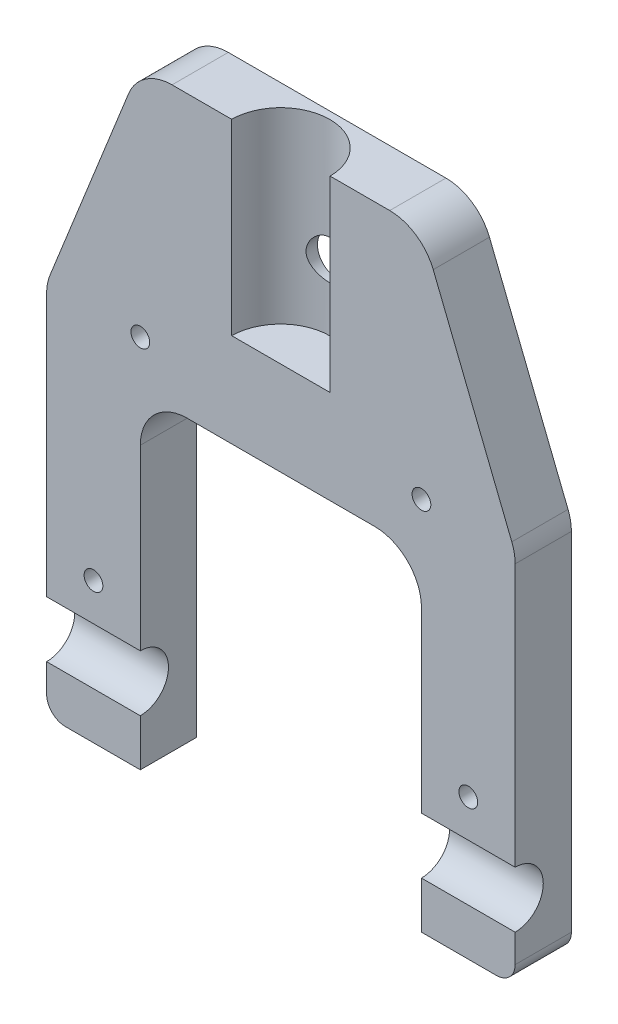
ISO-10303-21;
HEADER;
FILE_DESCRIPTION(('STEP AP214'),'2;1');
FILE_NAME('part.step','',(''),(''),'','','');
FILE_SCHEMA(('AUTOMOTIVE_DESIGN { 1 0 10303 214 1 1 1 1 }'));
ENDSEC;
DATA;
#1=APPLICATION_CONTEXT('core data for automotive mechanical design processes');
#2=APPLICATION_PROTOCOL_DEFINITION('international standard','automotive_design',2000,#1);
#3=PRODUCT_CONTEXT('',#1,'mechanical');
#4=PRODUCT('Part','Part','',(#3));
#5=PRODUCT_RELATED_PRODUCT_CATEGORY('part','',(#4));
#6=PRODUCT_DEFINITION_FORMATION('','',#4);
#7=PRODUCT_DEFINITION_CONTEXT('part definition',#1,'design');
#8=PRODUCT_DEFINITION('design','',#6,#7);
#9=PRODUCT_DEFINITION_SHAPE('','',#8);
#10=(LENGTH_UNIT() NAMED_UNIT(*) SI_UNIT(.MILLI.,.METRE.));
#11=(NAMED_UNIT(*) PLANE_ANGLE_UNIT() SI_UNIT($,.RADIAN.));
#12=(NAMED_UNIT(*) SI_UNIT($,.STERADIAN.) SOLID_ANGLE_UNIT());
#13=UNCERTAINTY_MEASURE_WITH_UNIT(LENGTH_MEASURE(1.E-05),#10,'distance_accuracy_value','');
#14=(GEOMETRIC_REPRESENTATION_CONTEXT(3) GLOBAL_UNCERTAINTY_ASSIGNED_CONTEXT((#13)) GLOBAL_UNIT_ASSIGNED_CONTEXT((#10,
#11,#12)) REPRESENTATION_CONTEXT('',''));
#15=CARTESIAN_POINT('',(0.,0.,0.));
#16=DIRECTION('',(0.,0.,1.));
#17=DIRECTION('',(1.,0.,0.));
#18=AXIS2_PLACEMENT_3D('',#15,#16,#17);
#19=CARTESIAN_POINT('',(5.,39.0370879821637,6.));
#20=DIRECTION('',(0.,0.,-1.));
#21=DIRECTION('',(-1.,0.,0.));
#22=AXIS2_PLACEMENT_3D('',#19,#20,#21);
#23=PLANE('',#22);
#24=CARTESIAN_POINT('',(40.,40.,6.));
#25=DIRECTION('',(0.,0.,1.));
#26=DIRECTION('',(-1.,0.,0.));
#27=AXIS2_PLACEMENT_3D('',#24,#25,#26);
#28=CIRCLE('',#27,0.999999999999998);
#29=CARTESIAN_POINT('',(39.,40.,6.));
#30=VERTEX_POINT('',#29);
#31=EDGE_CURVE('E511',#30,#30,#28,.T.);
#32=ORIENTED_EDGE('',*,*,#31,.F.);
#33=EDGE_LOOP('',(#32));
#34=FACE_BOUND('',#33,.T.);
#35=CARTESIAN_POINT('',(45.,15.,6.));
#36=DIRECTION('',(0.,0.,1.));
#37=DIRECTION('',(-1.,0.,0.));
#38=AXIS2_PLACEMENT_3D('',#35,#36,#37);
#39=CIRCLE('',#38,0.999999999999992);
#40=CARTESIAN_POINT('',(44.,15.,6.));
#41=VERTEX_POINT('',#40);
#42=EDGE_CURVE('E506',#41,#41,#39,.T.);
#43=ORIENTED_EDGE('',*,*,#42,.F.);
#44=EDGE_LOOP('',(#43));
#45=FACE_BOUND('',#44,.T.);
#46=CARTESIAN_POINT('',(10.,40.,6.));
#47=DIRECTION('',(0.,0.,1.));
#48=DIRECTION('',(1.,0.,0.));
#49=AXIS2_PLACEMENT_3D('',#46,#47,#48);
#50=CIRCLE('',#49,1.);
#51=CARTESIAN_POINT('',(11.,40.,6.));
#52=VERTEX_POINT('',#51);
#53=EDGE_CURVE('E500',#52,#52,#50,.T.);
#54=ORIENTED_EDGE('',*,*,#53,.F.);
#55=EDGE_LOOP('',(#54));
#56=FACE_BOUND('',#55,.T.);
#57=CARTESIAN_POINT('',(5.,15.,6.));
#58=DIRECTION('',(0.,0.,1.));
#59=DIRECTION('',(1.,0.,0.));
#60=AXIS2_PLACEMENT_3D('',#57,#58,#59);
#61=CIRCLE('',#60,1.);
#62=CARTESIAN_POINT('',(6.,15.,6.));
#63=VERTEX_POINT('',#62);
#64=EDGE_CURVE('E494',#63,#63,#61,.T.);
#65=ORIENTED_EDGE('',*,*,#64,.F.);
#66=EDGE_LOOP('',(#65));
#67=FACE_BOUND('',#66,.T.);
#68=DIRECTION('',(0.,-1.,0.));
#69=VECTOR('',#68,1.);
#70=CARTESIAN_POINT('',(0.,2.00000000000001,6.));
#71=LINE('',#70,#69);
#72=CARTESIAN_POINT('',(0.,39.0370879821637,6.));
#73=VERTEX_POINT('',#72);
#74=CARTESIAN_POINT('',(0.,11.,6.));
#75=VERTEX_POINT('',#74);
#76=EDGE_CURVE('E198',#73,#75,#71,.T.);
#77=ORIENTED_EDGE('',*,*,#76,.T.);
#78=DIRECTION('',(1.,0.,0.));
#79=VECTOR('',#78,1.);
#80=CARTESIAN_POINT('',(0.,11.,6.));
#81=LINE('',#80,#79);
#82=CARTESIAN_POINT('',(10.,11.,6.));
#83=VERTEX_POINT('',#82);
#84=EDGE_CURVE('E184',#75,#83,#81,.T.);
#85=ORIENTED_EDGE('',*,*,#84,.T.);
#86=DIRECTION('',(0.,-1.,0.));
#87=VECTOR('',#86,1.);
#88=CARTESIAN_POINT('',(10.,30.,6.));
#89=LINE('',#88,#87);
#90=CARTESIAN_POINT('',(10.,30.,6.));
#91=VERTEX_POINT('',#90);
#92=EDGE_CURVE('E381',#91,#83,#89,.T.);
#93=ORIENTED_EDGE('',*,*,#92,.F.);
#94=CARTESIAN_POINT('',(15.,30.,6.));
#95=DIRECTION('',(0.,0.,1.));
#96=DIRECTION('',(1.,0.,0.));
#97=AXIS2_PLACEMENT_3D('',#94,#95,#96);
#98=CIRCLE('',#97,5.);
#99=CARTESIAN_POINT('',(15.,35.,6.));
#100=VERTEX_POINT('',#99);
#101=EDGE_CURVE('E382',#100,#91,#98,.T.);
#102=ORIENTED_EDGE('',*,*,#101,.F.);
#103=DIRECTION('',(-1.,0.,0.));
#104=VECTOR('',#103,1.);
#105=CARTESIAN_POINT('',(15.,35.,6.));
#106=LINE('',#105,#104);
#107=CARTESIAN_POINT('',(35.,35.,6.));
#108=VERTEX_POINT('',#107);
#109=EDGE_CURVE('E386',#108,#100,#106,.T.);
#110=ORIENTED_EDGE('',*,*,#109,.F.);
#111=CARTESIAN_POINT('',(35.,30.,6.));
#112=DIRECTION('',(0.,0.,1.));
#113=DIRECTION('',(-1.,0.,0.));
#114=AXIS2_PLACEMENT_3D('',#111,#112,#113);
#115=CIRCLE('',#114,5.);
#116=CARTESIAN_POINT('',(40.,30.,6.));
#117=VERTEX_POINT('',#116);
#118=EDGE_CURVE('E484',#117,#108,#115,.T.);
#119=ORIENTED_EDGE('',*,*,#118,.F.);
#120=DIRECTION('',(0.,1.,0.));
#121=VECTOR('',#120,1.);
#122=CARTESIAN_POINT('',(40.,30.,6.));
#123=LINE('',#122,#121);
#124=CARTESIAN_POINT('',(40.,11.,6.));
#125=VERTEX_POINT('',#124);
#126=EDGE_CURVE('E481',#125,#117,#123,.T.);
#127=ORIENTED_EDGE('',*,*,#126,.F.);
#128=CARTESIAN_POINT('',(50.,11.,6.));
#129=VERTEX_POINT('',#128);
#130=EDGE_CURVE('E41',#125,#129,#81,.T.);
#131=ORIENTED_EDGE('',*,*,#130,.T.);
#132=DIRECTION('',(0.,1.,0.));
#133=VECTOR('',#132,1.);
#134=CARTESIAN_POINT('',(50.,39.0370879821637,6.));
#135=LINE('',#134,#133);
#136=CARTESIAN_POINT('',(50.,39.0370879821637,6.));
#137=VERTEX_POINT('',#136);
#138=EDGE_CURVE('E219',#129,#137,#135,.T.);
#139=ORIENTED_EDGE('',*,*,#138,.T.);
#140=CARTESIAN_POINT('',(45.,39.0370879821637,6.));
#141=DIRECTION('',(0.,0.,1.));
#142=DIRECTION('',(-1.,0.,0.));
#143=AXIS2_PLACEMENT_3D('',#140,#141,#142);
#144=CIRCLE('',#143,5.);
#145=CARTESIAN_POINT('',(49.6423834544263,40.8940413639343,6.));
#146=VERTEX_POINT('',#145);
#147=EDGE_CURVE('E223',#137,#146,#144,.T.);
#148=ORIENTED_EDGE('',*,*,#147,.T.);
#149=DIRECTION('',(-0.371390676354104,0.928476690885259,0.));
#150=VECTOR('',#149,1.);
#151=CARTESIAN_POINT('',(41.2572186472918,61.8569533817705,6.));
#152=LINE('',#151,#150);
#153=CARTESIAN_POINT('',(41.2572186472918,61.8569533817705,6.));
#154=VERTEX_POINT('',#153);
#155=EDGE_CURVE('E225',#146,#154,#152,.T.);
#156=ORIENTED_EDGE('',*,*,#155,.T.);
#157=CARTESIAN_POINT('',(36.6148351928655,60.,6.));
#158=DIRECTION('',(0.,0.,1.));
#159=DIRECTION('',(-1.,0.,0.));
#160=AXIS2_PLACEMENT_3D('',#157,#158,#159);
#161=CIRCLE('',#160,5.);
#162=CARTESIAN_POINT('',(36.6148351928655,65.,6.));
#163=VERTEX_POINT('',#162);
#164=EDGE_CURVE('E227',#154,#163,#161,.T.);
#165=ORIENTED_EDGE('',*,*,#164,.T.);
#166=DIRECTION('',(-1.,0.,0.));
#167=VECTOR('',#166,1.);
#168=CARTESIAN_POINT('',(13.3851648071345,65.,6.));
#169=LINE('',#168,#167);
#170=CARTESIAN_POINT('',(30.2499348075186,65.,6.));
#171=VERTEX_POINT('',#170);
#172=EDGE_CURVE('E230',#163,#171,#169,.T.);
#173=ORIENTED_EDGE('',*,*,#172,.T.);
#174=DIRECTION('',(0.,1.,0.));
#175=VECTOR('',#174,1.);
#176=CARTESIAN_POINT('',(30.2499348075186,45.,6.));
#177=LINE('',#176,#175);
#178=CARTESIAN_POINT('',(30.2499348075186,45.,6.));
#179=VERTEX_POINT('',#178);
#180=EDGE_CURVE('E280',#171,#179,#177,.F.);
#181=ORIENTED_EDGE('',*,*,#180,.T.);
#182=DIRECTION('',(1.,0.,0.));
#183=VECTOR('',#182,1.);
#184=CARTESIAN_POINT('',(5.,45.,6.));
#185=LINE('',#184,#183);
#186=CARTESIAN_POINT('',(19.7500651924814,45.,6.));
#187=VERTEX_POINT('',#186);
#188=EDGE_CURVE('E272',#187,#179,#185,.T.);
#189=ORIENTED_EDGE('',*,*,#188,.F.);
#190=DIRECTION('',(0.,1.,0.));
#191=VECTOR('',#190,1.);
#192=CARTESIAN_POINT('',(19.7500651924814,45.,6.));
#193=LINE('',#192,#191);
#194=CARTESIAN_POINT('',(19.7500651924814,65.,6.));
#195=VERTEX_POINT('',#194);
#196=EDGE_CURVE('E408',#187,#195,#193,.T.);
#197=ORIENTED_EDGE('',*,*,#196,.T.);
#198=CARTESIAN_POINT('',(13.3851648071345,65.,6.));
#199=VERTEX_POINT('',#198);
#200=EDGE_CURVE('E229',#195,#199,#169,.T.);
#201=ORIENTED_EDGE('',*,*,#200,.T.);
#202=CARTESIAN_POINT('',(13.3851648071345,60.,6.));
#203=DIRECTION('',(0.,0.,1.));
#204=DIRECTION('',(-1.,0.,0.));
#205=AXIS2_PLACEMENT_3D('',#202,#203,#204);
#206=CIRCLE('',#205,5.);
#207=CARTESIAN_POINT('',(8.7427813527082,61.8569533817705,6.));
#208=VERTEX_POINT('',#207);
#209=EDGE_CURVE('E233',#199,#208,#206,.T.);
#210=ORIENTED_EDGE('',*,*,#209,.T.);
#211=DIRECTION('',(-0.371390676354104,-0.928476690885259,0.));
#212=VECTOR('',#211,1.);
#213=CARTESIAN_POINT('',(0.35761654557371,40.8940413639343,6.));
#214=LINE('',#213,#212);
#215=CARTESIAN_POINT('',(0.35761654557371,40.8940413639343,6.));
#216=VERTEX_POINT('',#215);
#217=EDGE_CURVE('E235',#208,#216,#214,.T.);
#218=ORIENTED_EDGE('',*,*,#217,.T.);
#219=CARTESIAN_POINT('',(5.,39.0370879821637,6.));
#220=DIRECTION('',(0.,0.,1.));
#221=DIRECTION('',(-1.,0.,0.));
#222=AXIS2_PLACEMENT_3D('',#219,#220,#221);
#223=CIRCLE('',#222,5.);
#224=EDGE_CURVE('E205',#216,#73,#223,.T.);
#225=ORIENTED_EDGE('',*,*,#224,.T.);
#226=EDGE_LOOP('',(#77,#85,#93,#102,#110,#119,#127,#131,#139,#148,#156,#165,#173,#181,#189,#197,
#201,#210,#218,#225));
#227=FACE_BOUND('',#226,.T.);
#228=ADVANCED_FACE('F26',(#34,#45,#56,#67,#227),#23,.F.);
#229=CARTESIAN_POINT('',(50.,2.00000000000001,6.));
#230=VERTEX_POINT('',#229);
#231=CARTESIAN_POINT('',(50.,5.,6.));
#232=VERTEX_POINT('',#231);
#233=EDGE_CURVE('E220',#230,#232,#135,.T.);
#234=ORIENTED_EDGE('',*,*,#233,.T.);
#235=DIRECTION('',(1.,0.,0.));
#236=VECTOR('',#235,1.);
#237=CARTESIAN_POINT('',(0.,5.,6.));
#238=LINE('',#237,#236);
#239=CARTESIAN_POINT('',(40.,5.,6.));
#240=VERTEX_POINT('',#239);
#241=EDGE_CURVE('E485',#232,#240,#238,.F.);
#242=ORIENTED_EDGE('',*,*,#241,.T.);
#243=CARTESIAN_POINT('',(40.,0.,6.));
#244=VERTEX_POINT('',#243);
#245=EDGE_CURVE('E482',#244,#240,#123,.T.);
#246=ORIENTED_EDGE('',*,*,#245,.F.);
#247=DIRECTION('',(1.,0.,0.));
#248=VECTOR('',#247,1.);
#249=CARTESIAN_POINT('',(48.,0.,6.));
#250=LINE('',#249,#248);
#251=CARTESIAN_POINT('',(48.,0.,6.));
#252=VERTEX_POINT('',#251);
#253=EDGE_CURVE('E209',#244,#252,#250,.T.);
#254=ORIENTED_EDGE('',*,*,#253,.T.);
#255=CARTESIAN_POINT('',(48.,2.,6.));
#256=DIRECTION('',(0.,0.,1.));
#257=DIRECTION('',(-1.,0.,0.));
#258=AXIS2_PLACEMENT_3D('',#255,#256,#257);
#259=CIRCLE('',#258,2.);
#260=EDGE_CURVE('E217',#252,#230,#259,.T.);
#261=ORIENTED_EDGE('',*,*,#260,.T.);
#262=EDGE_LOOP('',(#234,#242,#246,#254,#261));
#263=FACE_BOUND('',#262,.T.);
#264=ADVANCED_FACE('F353',(#263),#23,.F.);
#265=CARTESIAN_POINT('',(48.,0.,6.));
#266=DIRECTION('',(0.,1.,0.));
#267=DIRECTION('',(0.,0.,1.));
#268=AXIS2_PLACEMENT_3D('',#265,#266,#267);
#269=PLANE('',#268);
#270=ORIENTED_EDGE('',*,*,#253,.F.);
#271=DIRECTION('',(0.,0.,-1.));
#272=VECTOR('',#271,1.);
#273=CARTESIAN_POINT('',(40.,0.,6.));
#274=LINE('',#273,#272);
#275=CARTESIAN_POINT('',(40.,0.,0.));
#276=VERTEX_POINT('',#275);
#277=EDGE_CURVE('E459',#244,#276,#274,.T.);
#278=ORIENTED_EDGE('',*,*,#277,.T.);
#279=DIRECTION('',(1.,0.,0.));
#280=VECTOR('',#279,1.);
#281=CARTESIAN_POINT('',(48.,0.,0.));
#282=LINE('',#281,#280);
#283=CARTESIAN_POINT('',(48.,0.,0.));
#284=VERTEX_POINT('',#283);
#285=EDGE_CURVE('E421',#276,#284,#282,.T.);
#286=ORIENTED_EDGE('',*,*,#285,.T.);
#287=DIRECTION('',(0.,0.,-1.));
#288=VECTOR('',#287,1.);
#289=CARTESIAN_POINT('',(48.,0.,6.));
#290=LINE('',#289,#288);
#291=EDGE_CURVE('E261',#252,#284,#290,.T.);
#292=ORIENTED_EDGE('',*,*,#291,.F.);
#293=EDGE_LOOP('',(#270,#278,#286,#292));
#294=FACE_BOUND('',#293,.T.);
#295=ADVANCED_FACE('F360',(#294),#269,.F.);
#296=CARTESIAN_POINT('',(10.,5.,6.));
#297=VERTEX_POINT('',#296);
#298=CARTESIAN_POINT('',(10.,0.,6.));
#299=VERTEX_POINT('',#298);
#300=EDGE_CURVE('E378',#297,#299,#89,.T.);
#301=ORIENTED_EDGE('',*,*,#300,.F.);
#302=CARTESIAN_POINT('',(0.,5.,6.));
#303=VERTEX_POINT('',#302);
#304=EDGE_CURVE('E49',#297,#303,#238,.F.);
#305=ORIENTED_EDGE('',*,*,#304,.T.);
#306=CARTESIAN_POINT('',(0.,2.00000000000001,6.));
#307=VERTEX_POINT('',#306);
#308=EDGE_CURVE('E201',#303,#307,#71,.T.);
#309=ORIENTED_EDGE('',*,*,#308,.T.);
#310=CARTESIAN_POINT('',(2.,2.,6.));
#311=DIRECTION('',(0.,0.,1.));
#312=DIRECTION('',(1.,0.,0.));
#313=AXIS2_PLACEMENT_3D('',#310,#311,#312);
#314=CIRCLE('',#313,2.);
#315=CARTESIAN_POINT('',(2.00000000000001,0.,6.));
#316=VERTEX_POINT('',#315);
#317=EDGE_CURVE('E207',#307,#316,#314,.T.);
#318=ORIENTED_EDGE('',*,*,#317,.T.);
#319=EDGE_CURVE('E214',#316,#299,#250,.T.);
#320=ORIENTED_EDGE('',*,*,#319,.T.);
#321=EDGE_LOOP('',(#301,#305,#309,#318,#320));
#322=FACE_BOUND('',#321,.T.);
#323=ADVANCED_FACE('F356',(#322),#23,.F.);
#324=CARTESIAN_POINT('',(5.,39.0370879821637,0.));
#325=DIRECTION('',(0.,0.,-1.));
#326=DIRECTION('',(-1.,0.,0.));
#327=AXIS2_PLACEMENT_3D('',#324,#325,#326);
#328=PLANE('',#327);
#329=DIRECTION('',(0.,-1.,0.));
#330=VECTOR('',#329,1.);
#331=CARTESIAN_POINT('',(40.,39.0370879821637,0.));
#332=LINE('',#331,#330);
#333=CARTESIAN_POINT('',(40.,30.,0.));
#334=VERTEX_POINT('',#333);
#335=EDGE_CURVE('E400',#334,#276,#332,.T.);
#336=ORIENTED_EDGE('',*,*,#335,.F.);
#337=CARTESIAN_POINT('',(35.,30.,0.));
#338=DIRECTION('',(0.,0.,-1.));
#339=DIRECTION('',(-1.,0.,0.));
#340=AXIS2_PLACEMENT_3D('',#337,#338,#339);
#341=CIRCLE('',#340,5.);
#342=CARTESIAN_POINT('',(35.,35.,0.));
#343=VERTEX_POINT('',#342);
#344=EDGE_CURVE('E461',#343,#334,#341,.T.);
#345=ORIENTED_EDGE('',*,*,#344,.F.);
#346=DIRECTION('',(1.,0.,0.));
#347=VECTOR('',#346,1.);
#348=CARTESIAN_POINT('',(5.,35.,0.));
#349=LINE('',#348,#347);
#350=CARTESIAN_POINT('',(15.,35.,0.));
#351=VERTEX_POINT('',#350);
#352=EDGE_CURVE('E465',#351,#343,#349,.T.);
#353=ORIENTED_EDGE('',*,*,#352,.F.);
#354=CARTESIAN_POINT('',(15.,30.,0.));
#355=DIRECTION('',(0.,0.,-1.));
#356=DIRECTION('',(-1.,0.,0.));
#357=AXIS2_PLACEMENT_3D('',#354,#355,#356);
#358=CIRCLE('',#357,5.);
#359=CARTESIAN_POINT('',(10.,30.,0.));
#360=VERTEX_POINT('',#359);
#361=EDGE_CURVE('E34',#360,#351,#358,.T.);
#362=ORIENTED_EDGE('',*,*,#361,.F.);
#363=DIRECTION('',(0.,1.,0.));
#364=VECTOR('',#363,1.);
#365=CARTESIAN_POINT('',(10.,39.0370879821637,0.));
#366=LINE('',#365,#364);
#367=CARTESIAN_POINT('',(10.,0.,0.));
#368=VERTEX_POINT('',#367);
#369=EDGE_CURVE('E392',#368,#360,#366,.T.);
#370=ORIENTED_EDGE('',*,*,#369,.F.);
#371=CARTESIAN_POINT('',(2.00000000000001,0.,0.));
#372=VERTEX_POINT('',#371);
#373=EDGE_CURVE('E422',#372,#368,#282,.T.);
#374=ORIENTED_EDGE('',*,*,#373,.F.);
#375=CARTESIAN_POINT('',(2.,2.,0.));
#376=DIRECTION('',(0.,0.,1.));
#377=DIRECTION('',(1.,0.,0.));
#378=AXIS2_PLACEMENT_3D('',#375,#376,#377);
#379=CIRCLE('',#378,2.);
#380=CARTESIAN_POINT('',(0.,2.00000000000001,0.));
#381=VERTEX_POINT('',#380);
#382=EDGE_CURVE('E419',#381,#372,#379,.T.);
#383=ORIENTED_EDGE('',*,*,#382,.F.);
#384=DIRECTION('',(0.,-1.,0.));
#385=VECTOR('',#384,1.);
#386=CARTESIAN_POINT('',(0.,2.00000000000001,0.));
#387=LINE('',#386,#385);
#388=CARTESIAN_POINT('',(0.,39.0370879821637,0.));
#389=VERTEX_POINT('',#388);
#390=EDGE_CURVE('E417',#389,#381,#387,.T.);
#391=ORIENTED_EDGE('',*,*,#390,.F.);
#392=CARTESIAN_POINT('',(5.,39.0370879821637,0.));
#393=DIRECTION('',(0.,0.,1.));
#394=DIRECTION('',(-1.,0.,0.));
#395=AXIS2_PLACEMENT_3D('',#392,#393,#394);
#396=CIRCLE('',#395,5.);
#397=CARTESIAN_POINT('',(0.35761654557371,40.8940413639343,0.));
#398=VERTEX_POINT('',#397);
#399=EDGE_CURVE('E414',#398,#389,#396,.T.);
#400=ORIENTED_EDGE('',*,*,#399,.F.);
#401=DIRECTION('',(-0.371390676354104,-0.928476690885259,0.));
#402=VECTOR('',#401,1.);
#403=CARTESIAN_POINT('',(0.35761654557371,40.8940413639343,0.));
#404=LINE('',#403,#402);
#405=CARTESIAN_POINT('',(8.7427813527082,61.8569533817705,0.));
#406=VERTEX_POINT('',#405);
#407=EDGE_CURVE('E438',#406,#398,#404,.T.);
#408=ORIENTED_EDGE('',*,*,#407,.F.);
#409=CARTESIAN_POINT('',(13.3851648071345,60.,0.));
#410=DIRECTION('',(0.,0.,1.));
#411=DIRECTION('',(-1.,0.,0.));
#412=AXIS2_PLACEMENT_3D('',#409,#410,#411);
#413=CIRCLE('',#412,5.);
#414=CARTESIAN_POINT('',(13.3851648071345,65.,0.));
#415=VERTEX_POINT('',#414);
#416=EDGE_CURVE('E437',#415,#406,#413,.T.);
#417=ORIENTED_EDGE('',*,*,#416,.F.);
#418=DIRECTION('',(-1.,0.,0.));
#419=VECTOR('',#418,1.);
#420=CARTESIAN_POINT('',(13.3851648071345,65.,0.));
#421=LINE('',#420,#419);
#422=CARTESIAN_POINT('',(36.6148351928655,65.,0.));
#423=VERTEX_POINT('',#422);
#424=EDGE_CURVE('E435',#423,#415,#421,.T.);
#425=ORIENTED_EDGE('',*,*,#424,.F.);
#426=CARTESIAN_POINT('',(36.6148351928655,60.,0.));
#427=DIRECTION('',(0.,0.,1.));
#428=DIRECTION('',(-1.,0.,0.));
#429=AXIS2_PLACEMENT_3D('',#426,#427,#428);
#430=CIRCLE('',#429,5.);
#431=CARTESIAN_POINT('',(41.2572186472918,61.8569533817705,0.));
#432=VERTEX_POINT('',#431);
#433=EDGE_CURVE('E433',#432,#423,#430,.T.);
#434=ORIENTED_EDGE('',*,*,#433,.F.);
#435=DIRECTION('',(-0.371390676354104,0.928476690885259,0.));
#436=VECTOR('',#435,1.);
#437=CARTESIAN_POINT('',(41.2572186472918,61.8569533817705,0.));
#438=LINE('',#437,#436);
#439=CARTESIAN_POINT('',(49.6423834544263,40.8940413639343,0.));
#440=VERTEX_POINT('',#439);
#441=EDGE_CURVE('E431',#440,#432,#438,.T.);
#442=ORIENTED_EDGE('',*,*,#441,.F.);
#443=CARTESIAN_POINT('',(45.,39.0370879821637,0.));
#444=DIRECTION('',(0.,0.,1.));
#445=DIRECTION('',(-1.,0.,0.));
#446=AXIS2_PLACEMENT_3D('',#443,#444,#445);
#447=CIRCLE('',#446,5.);
#448=CARTESIAN_POINT('',(50.,39.0370879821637,0.));
#449=VERTEX_POINT('',#448);
#450=EDGE_CURVE('E429',#449,#440,#447,.T.);
#451=ORIENTED_EDGE('',*,*,#450,.F.);
#452=DIRECTION('',(0.,1.,0.));
#453=VECTOR('',#452,1.);
#454=CARTESIAN_POINT('',(50.,39.0370879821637,0.));
#455=LINE('',#454,#453);
#456=CARTESIAN_POINT('',(50.,2.00000000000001,0.));
#457=VERTEX_POINT('',#456);
#458=EDGE_CURVE('E427',#457,#449,#455,.T.);
#459=ORIENTED_EDGE('',*,*,#458,.F.);
#460=CARTESIAN_POINT('',(48.,2.,0.));
#461=DIRECTION('',(0.,0.,1.));
#462=DIRECTION('',(-1.,0.,0.));
#463=AXIS2_PLACEMENT_3D('',#460,#461,#462);
#464=CIRCLE('',#463,2.);
#465=EDGE_CURVE('E425',#284,#457,#464,.T.);
#466=ORIENTED_EDGE('',*,*,#465,.F.);
#467=ORIENTED_EDGE('',*,*,#285,.F.);
#468=EDGE_LOOP('',(#336,#345,#353,#362,#370,#374,#383,#391,#400,#408,#417,#425,#434,#442,#451,
#459,#466,#467));
#469=FACE_BOUND('',#468,.T.);
#470=CARTESIAN_POINT('',(25.,52.,0.));
#471=DIRECTION('',(0.,0.,1.));
#472=DIRECTION('',(1.,0.,0.));
#473=AXIS2_PLACEMENT_3D('',#470,#471,#472);
#474=CIRCLE('',#473,2.1);
#475=CARTESIAN_POINT('',(27.1,52.,0.));
#476=VERTEX_POINT('',#475);
#477=EDGE_CURVE('E411',#476,#476,#474,.T.);
#478=ORIENTED_EDGE('',*,*,#477,.T.);
#479=EDGE_LOOP('',(#478));
#480=FACE_BOUND('',#479,.T.);
#481=ADVANCED_FACE('F366',(#469,#480),#328,.T.);
#482=CARTESIAN_POINT('',(5.,39.0370879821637,6.));
#483=DIRECTION('',(0.,0.,-1.));
#484=DIRECTION('',(-1.,0.,0.));
#485=AXIS2_PLACEMENT_3D('',#482,#483,#484);
#486=CYLINDRICAL_SURFACE('',#485,5.);
#487=ORIENTED_EDGE('',*,*,#399,.T.);
#488=DIRECTION('',(0.,0.,-1.));
#489=VECTOR('',#488,1.);
#490=CARTESIAN_POINT('',(0.,39.0370879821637,6.));
#491=LINE('',#490,#489);
#492=EDGE_CURVE('E270',#73,#389,#491,.T.);
#493=ORIENTED_EDGE('',*,*,#492,.F.);
#494=ORIENTED_EDGE('',*,*,#224,.F.);
#495=DIRECTION('',(0.,0.,-1.));
#496=VECTOR('',#495,1.);
#497=CARTESIAN_POINT('',(0.35761654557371,40.8940413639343,6.));
#498=LINE('',#497,#496);
#499=EDGE_CURVE('E237',#216,#398,#498,.T.);
#500=ORIENTED_EDGE('',*,*,#499,.T.);
#501=EDGE_LOOP('',(#487,#493,#494,#500));
#502=FACE_BOUND('',#501,.T.);
#503=ADVANCED_FACE('F28',(#502),#486,.T.);
#504=CARTESIAN_POINT('',(0.,2.00000000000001,6.));
#505=DIRECTION('',(1.,0.,0.));
#506=DIRECTION('',(0.,0.,-1.));
#507=AXIS2_PLACEMENT_3D('',#504,#505,#506);
#508=PLANE('',#507);
#509=ORIENTED_EDGE('',*,*,#308,.F.);
#510=CARTESIAN_POINT('',(0.,8.,6.));
#511=DIRECTION('',(1.,0.,0.));
#512=DIRECTION('',(0.,0.,-1.));
#513=AXIS2_PLACEMENT_3D('',#510,#511,#512);
#514=CIRCLE('',#513,3.);
#515=EDGE_CURVE('E187',#303,#75,#514,.T.);
#516=ORIENTED_EDGE('',*,*,#515,.T.);
#517=ORIENTED_EDGE('',*,*,#76,.F.);
#518=ORIENTED_EDGE('',*,*,#492,.T.);
#519=ORIENTED_EDGE('',*,*,#390,.T.);
#520=DIRECTION('',(0.,0.,-1.));
#521=VECTOR('',#520,1.);
#522=CARTESIAN_POINT('',(0.,2.00000000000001,6.));
#523=LINE('',#522,#521);
#524=EDGE_CURVE('E267',#307,#381,#523,.T.);
#525=ORIENTED_EDGE('',*,*,#524,.F.);
#526=EDGE_LOOP('',(#509,#516,#517,#518,#519,#525));
#527=FACE_BOUND('',#526,.T.);
#528=ADVANCED_FACE('F196',(#527),#508,.F.);
#529=CARTESIAN_POINT('',(2.,2.,6.));
#530=DIRECTION('',(0.,0.,-1.));
#531=DIRECTION('',(-1.,0.,0.));
#532=AXIS2_PLACEMENT_3D('',#529,#530,#531);
#533=CYLINDRICAL_SURFACE('',#532,2.);
#534=ORIENTED_EDGE('',*,*,#382,.T.);
#535=DIRECTION('',(0.,0.,-1.));
#536=VECTOR('',#535,1.);
#537=CARTESIAN_POINT('',(2.00000000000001,0.,6.));
#538=LINE('',#537,#536);
#539=EDGE_CURVE('E264',#316,#372,#538,.T.);
#540=ORIENTED_EDGE('',*,*,#539,.F.);
#541=ORIENTED_EDGE('',*,*,#317,.F.);
#542=ORIENTED_EDGE('',*,*,#524,.T.);
#543=EDGE_LOOP('',(#534,#540,#541,#542));
#544=FACE_BOUND('',#543,.T.);
#545=ADVANCED_FACE('F454',(#544),#533,.T.);
#546=ORIENTED_EDGE('',*,*,#373,.T.);
#547=DIRECTION('',(0.,0.,1.));
#548=VECTOR('',#547,1.);
#549=CARTESIAN_POINT('',(10.,0.,6.));
#550=LINE('',#549,#548);
#551=EDGE_CURVE('E457',#368,#299,#550,.T.);
#552=ORIENTED_EDGE('',*,*,#551,.T.);
#553=ORIENTED_EDGE('',*,*,#319,.F.);
#554=ORIENTED_EDGE('',*,*,#539,.T.);
#555=EDGE_LOOP('',(#546,#552,#553,#554));
#556=FACE_BOUND('',#555,.T.);
#557=ADVANCED_FACE('F376',(#556),#269,.F.);
#558=CARTESIAN_POINT('',(48.,2.,6.));
#559=DIRECTION('',(0.,0.,-1.));
#560=DIRECTION('',(-1.,0.,0.));
#561=AXIS2_PLACEMENT_3D('',#558,#559,#560);
#562=CYLINDRICAL_SURFACE('',#561,2.);
#563=ORIENTED_EDGE('',*,*,#465,.T.);
#564=DIRECTION('',(0.,0.,-1.));
#565=VECTOR('',#564,1.);
#566=CARTESIAN_POINT('',(50.,2.00000000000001,6.));
#567=LINE('',#566,#565);
#568=EDGE_CURVE('E258',#230,#457,#567,.T.);
#569=ORIENTED_EDGE('',*,*,#568,.F.);
#570=ORIENTED_EDGE('',*,*,#260,.F.);
#571=ORIENTED_EDGE('',*,*,#291,.T.);
#572=EDGE_LOOP('',(#563,#569,#570,#571));
#573=FACE_BOUND('',#572,.T.);
#574=ADVANCED_FACE('F565',(#573),#562,.T.);
#575=CARTESIAN_POINT('',(50.,39.0370879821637,6.));
#576=DIRECTION('',(-1.,0.,0.));
#577=DIRECTION('',(0.,0.,1.));
#578=AXIS2_PLACEMENT_3D('',#575,#576,#577);
#579=PLANE('',#578);
#580=ORIENTED_EDGE('',*,*,#138,.F.);
#581=CARTESIAN_POINT('',(50.,8.,6.));
#582=DIRECTION('',(1.,0.,0.));
#583=DIRECTION('',(0.,0.,-1.));
#584=AXIS2_PLACEMENT_3D('',#581,#582,#583);
#585=CIRCLE('',#584,3.);
#586=EDGE_CURVE('E202',#232,#129,#585,.T.);
#587=ORIENTED_EDGE('',*,*,#586,.F.);
#588=ORIENTED_EDGE('',*,*,#233,.F.);
#589=ORIENTED_EDGE('',*,*,#568,.T.);
#590=ORIENTED_EDGE('',*,*,#458,.T.);
#591=DIRECTION('',(0.,0.,-1.));
#592=VECTOR('',#591,1.);
#593=CARTESIAN_POINT('',(50.,39.0370879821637,6.));
#594=LINE('',#593,#592);
#595=EDGE_CURVE('E255',#137,#449,#594,.T.);
#596=ORIENTED_EDGE('',*,*,#595,.F.);
#597=EDGE_LOOP('',(#580,#587,#588,#589,#590,#596));
#598=FACE_BOUND('',#597,.T.);
#599=ADVANCED_FACE('F532',(#598),#579,.F.);
#600=CARTESIAN_POINT('',(45.,39.0370879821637,6.));
#601=DIRECTION('',(0.,0.,-1.));
#602=DIRECTION('',(-1.,0.,0.));
#603=AXIS2_PLACEMENT_3D('',#600,#601,#602);
#604=CYLINDRICAL_SURFACE('',#603,5.);
#605=ORIENTED_EDGE('',*,*,#450,.T.);
#606=DIRECTION('',(0.,0.,-1.));
#607=VECTOR('',#606,1.);
#608=CARTESIAN_POINT('',(49.6423834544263,40.8940413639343,6.));
#609=LINE('',#608,#607);
#610=EDGE_CURVE('E252',#146,#440,#609,.T.);
#611=ORIENTED_EDGE('',*,*,#610,.F.);
#612=ORIENTED_EDGE('',*,*,#147,.F.);
#613=ORIENTED_EDGE('',*,*,#595,.T.);
#614=EDGE_LOOP('',(#605,#611,#612,#613));
#615=FACE_BOUND('',#614,.T.);
#616=ADVANCED_FACE('F538',(#615),#604,.T.);
#617=CARTESIAN_POINT('',(41.2572186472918,61.8569533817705,6.));
#618=DIRECTION('',(-0.928476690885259,-0.371390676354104,0.));
#619=DIRECTION('',(0.371390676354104,-0.928476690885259,0.));
#620=AXIS2_PLACEMENT_3D('',#617,#618,#619);
#621=PLANE('',#620);
#622=ORIENTED_EDGE('',*,*,#441,.T.);
#623=DIRECTION('',(0.,0.,-1.));
#624=VECTOR('',#623,1.);
#625=CARTESIAN_POINT('',(41.2572186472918,61.8569533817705,6.));
#626=LINE('',#625,#624);
#627=EDGE_CURVE('E249',#154,#432,#626,.T.);
#628=ORIENTED_EDGE('',*,*,#627,.F.);
#629=ORIENTED_EDGE('',*,*,#155,.F.);
#630=ORIENTED_EDGE('',*,*,#610,.T.);
#631=EDGE_LOOP('',(#622,#628,#629,#630));
#632=FACE_BOUND('',#631,.T.);
#633=ADVANCED_FACE('F544',(#632),#621,.F.);
#634=CARTESIAN_POINT('',(36.6148351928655,60.,6.));
#635=DIRECTION('',(0.,0.,-1.));
#636=DIRECTION('',(-1.,0.,0.));
#637=AXIS2_PLACEMENT_3D('',#634,#635,#636);
#638=CYLINDRICAL_SURFACE('',#637,5.);
#639=ORIENTED_EDGE('',*,*,#433,.T.);
#640=DIRECTION('',(0.,0.,-1.));
#641=VECTOR('',#640,1.);
#642=CARTESIAN_POINT('',(36.6148351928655,65.,6.));
#643=LINE('',#642,#641);
#644=EDGE_CURVE('E246',#163,#423,#643,.T.);
#645=ORIENTED_EDGE('',*,*,#644,.F.);
#646=ORIENTED_EDGE('',*,*,#164,.F.);
#647=ORIENTED_EDGE('',*,*,#627,.T.);
#648=EDGE_LOOP('',(#639,#645,#646,#647));
#649=FACE_BOUND('',#648,.T.);
#650=ADVANCED_FACE('F548',(#649),#638,.T.);
#651=CARTESIAN_POINT('',(13.3851648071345,65.,6.));
#652=DIRECTION('',(0.,-1.,0.));
#653=DIRECTION('',(0.,0.,-1.));
#654=AXIS2_PLACEMENT_3D('',#651,#652,#653);
#655=PLANE('',#654);
#656=ORIENTED_EDGE('',*,*,#200,.F.);
#657=CARTESIAN_POINT('',(25.,65.,6.02616327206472));
#658=DIRECTION('',(0.,1.,0.));
#659=DIRECTION('',(0.,0.,1.));
#660=AXIS2_PLACEMENT_3D('',#657,#658,#659);
#661=CIRCLE('',#660,5.25);
#662=EDGE_CURVE('E402',#171,#195,#661,.T.);
#663=ORIENTED_EDGE('',*,*,#662,.F.);
#664=ORIENTED_EDGE('',*,*,#172,.F.);
#665=ORIENTED_EDGE('',*,*,#644,.T.);
#666=ORIENTED_EDGE('',*,*,#424,.T.);
#667=DIRECTION('',(0.,0.,-1.));
#668=VECTOR('',#667,1.);
#669=CARTESIAN_POINT('',(13.3851648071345,65.,6.));
#670=LINE('',#669,#668);
#671=EDGE_CURVE('E243',#199,#415,#670,.T.);
#672=ORIENTED_EDGE('',*,*,#671,.F.);
#673=EDGE_LOOP('',(#656,#663,#664,#665,#666,#672));
#674=FACE_BOUND('',#673,.T.);
#675=ADVANCED_FACE('F554',(#674),#655,.F.);
#676=CARTESIAN_POINT('',(13.3851648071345,60.,6.));
#677=DIRECTION('',(0.,0.,-1.));
#678=DIRECTION('',(-1.,0.,0.));
#679=AXIS2_PLACEMENT_3D('',#676,#677,#678);
#680=CYLINDRICAL_SURFACE('',#679,5.);
#681=ORIENTED_EDGE('',*,*,#416,.T.);
#682=DIRECTION('',(0.,0.,-1.));
#683=VECTOR('',#682,1.);
#684=CARTESIAN_POINT('',(8.7427813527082,61.8569533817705,6.));
#685=LINE('',#684,#683);
#686=EDGE_CURVE('E240',#208,#406,#685,.T.);
#687=ORIENTED_EDGE('',*,*,#686,.F.);
#688=ORIENTED_EDGE('',*,*,#209,.F.);
#689=ORIENTED_EDGE('',*,*,#671,.T.);
#690=EDGE_LOOP('',(#681,#687,#688,#689));
#691=FACE_BOUND('',#690,.T.);
#692=ADVANCED_FACE('F561',(#691),#680,.T.);
#693=CARTESIAN_POINT('',(0.35761654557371,40.8940413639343,6.));
#694=DIRECTION('',(0.928476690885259,-0.371390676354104,0.));
#695=DIRECTION('',(0.371390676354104,0.928476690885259,0.));
#696=AXIS2_PLACEMENT_3D('',#693,#694,#695);
#697=PLANE('',#696);
#698=ORIENTED_EDGE('',*,*,#407,.T.);
#699=ORIENTED_EDGE('',*,*,#499,.F.);
#700=ORIENTED_EDGE('',*,*,#217,.F.);
#701=ORIENTED_EDGE('',*,*,#686,.T.);
#702=EDGE_LOOP('',(#698,#699,#700,#701));
#703=FACE_BOUND('',#702,.T.);
#704=ADVANCED_FACE('F442',(#703),#697,.F.);
#705=CARTESIAN_POINT('',(25.,52.,6.));
#706=DIRECTION('',(0.,0.,-1.));
#707=DIRECTION('',(-1.,0.,0.));
#708=AXIS2_PLACEMENT_3D('',#705,#706,#707);
#709=CYLINDRICAL_SURFACE('',#708,2.1);
#710=CARTESIAN_POINT('',(22.9,52.,1.21445879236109));
#711=CARTESIAN_POINT('',(22.9000048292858,52.1124798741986,1.21445403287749));
#712=CARTESIAN_POINT('',(22.9090911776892,52.2251476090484,1.21045971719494));
#713=CARTESIAN_POINT('',(22.9450795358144,52.4472360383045,1.19499689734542));
#714=CARTESIAN_POINT('',(22.9720270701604,52.5566476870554,1.18350929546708));
#715=CARTESIAN_POINT('',(23.0425526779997,52.7686543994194,1.15457895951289));
#716=CARTESIAN_POINT('',(23.0860680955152,52.8712734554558,1.13715868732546));
#717=CARTESIAN_POINT('',(23.1883088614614,53.0677296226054,1.09835916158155));
#718=CARTESIAN_POINT('',(23.2470308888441,53.1615686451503,1.0769807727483));
#719=CARTESIAN_POINT('',(23.3816118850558,53.3432233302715,1.0313042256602));
#720=CARTESIAN_POINT('',(23.4582016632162,53.4304742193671,1.00691214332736));
#721=CARTESIAN_POINT('',(23.6248054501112,53.5913054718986,0.958732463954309));
#722=CARTESIAN_POINT('',(23.7148241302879,53.6648810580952,0.934945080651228));
#723=CARTESIAN_POINT('',(23.9100933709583,53.7990767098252,0.889527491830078));
#724=CARTESIAN_POINT('',(24.0158045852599,53.8590715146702,0.868019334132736));
#725=CARTESIAN_POINT('',(24.2368334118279,53.9601857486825,0.830722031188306));
#726=CARTESIAN_POINT('',(24.3521470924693,54.0013128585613,0.814930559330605));
#727=CARTESIAN_POINT('',(24.5831852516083,54.0615085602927,0.791510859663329));
#728=CARTESIAN_POINT('',(24.6986195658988,54.0815486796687,0.78352443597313));
#729=CARTESIAN_POINT('',(24.9314703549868,54.1021299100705,0.775320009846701));
#730=CARTESIAN_POINT('',(25.0488860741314,54.1026782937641,0.775099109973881));
#731=CARTESIAN_POINT('',(25.2753441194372,54.0847930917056,0.782232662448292));
#732=CARTESIAN_POINT('',(25.384486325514,54.0674239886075,0.789162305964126));
#733=CARTESIAN_POINT('',(25.598156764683,54.0160074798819,0.809245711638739));
#734=CARTESIAN_POINT('',(25.7026846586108,53.9819588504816,0.822399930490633));
#735=CARTESIAN_POINT('',(25.9060428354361,53.8977316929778,0.853896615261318));
#736=CARTESIAN_POINT('',(26.0047635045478,53.8473177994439,0.872314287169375));
#737=CARTESIAN_POINT('',(26.1925985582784,53.7320117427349,0.912510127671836));
#738=CARTESIAN_POINT('',(26.2817096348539,53.6671146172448,0.934289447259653));
#739=CARTESIAN_POINT('',(26.4540072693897,53.5197184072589,0.980686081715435));
#740=CARTESIAN_POINT('',(26.5364207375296,53.4363434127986,1.00539584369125));
#741=CARTESIAN_POINT('',(26.6864127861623,53.2568598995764,1.05376583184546));
#742=CARTESIAN_POINT('',(26.7539865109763,53.1607472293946,1.07742571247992));
#743=CARTESIAN_POINT('',(26.8741493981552,52.9550600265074,1.12164584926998));
#744=CARTESIAN_POINT('',(26.9262613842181,52.8451819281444,1.14209967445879));
#745=CARTESIAN_POINT('',(27.0109350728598,52.6171737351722,1.17634357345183));
#746=CARTESIAN_POINT('',(27.0435094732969,52.4990490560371,1.19013797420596));
#747=CARTESIAN_POINT('',(27.0863026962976,52.2656124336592,1.2084507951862));
#748=CARTESIAN_POINT('',(27.0977657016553,52.150569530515,1.21348442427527));
#749=CARTESIAN_POINT('',(27.101639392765,51.9201189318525,1.21517354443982));
#750=CARTESIAN_POINT('',(27.0940558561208,51.8047113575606,1.21183157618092));
#751=CARTESIAN_POINT('',(27.0611845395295,51.5837181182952,1.19767480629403));
#752=CARTESIAN_POINT('',(27.0369297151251,51.4779474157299,1.18729646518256));
#753=CARTESIAN_POINT('',(26.9727443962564,51.2720471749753,1.16077773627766));
#754=CARTESIAN_POINT('',(26.9328104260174,51.1719188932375,1.14463607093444));
#755=CARTESIAN_POINT('',(26.8365924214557,50.9756175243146,1.10760856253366));
#756=CARTESIAN_POINT('',(26.7797110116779,50.8797695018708,1.08655687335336));
#757=CARTESIAN_POINT('',(26.6518234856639,50.6985428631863,1.04233422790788));
#758=CARTESIAN_POINT('',(26.580811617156,50.6131685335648,1.01916241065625));
#759=CARTESIAN_POINT('',(26.4204864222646,50.4487579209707,0.971243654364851));
#760=CARTESIAN_POINT('',(26.3302087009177,50.3706556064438,0.946506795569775));
#761=CARTESIAN_POINT('',(26.1372378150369,50.2305640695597,0.899855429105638));
#762=CARTESIAN_POINT('',(26.03454414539,50.1685755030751,0.877941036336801));
#763=CARTESIAN_POINT('',(25.8192939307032,50.0626999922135,0.839334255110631));
#764=CARTESIAN_POINT('',(25.7067397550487,50.0188087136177,0.822640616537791));
#765=CARTESIAN_POINT('',(25.4750132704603,49.9508737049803,0.79639978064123));
#766=CARTESIAN_POINT('',(25.3558445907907,49.9268192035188,0.786848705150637));
#767=CARTESIAN_POINT('',(25.1226573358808,49.9005200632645,0.776383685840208));
#768=CARTESIAN_POINT('',(25.0088100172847,49.8969548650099,0.774946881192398));
#769=CARTESIAN_POINT('',(24.7821944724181,49.9082482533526,0.779459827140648));
#770=CARTESIAN_POINT('',(24.6694260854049,49.9231040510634,0.78540845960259));
#771=CARTESIAN_POINT('',(24.4517205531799,49.9698741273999,0.803762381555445));
#772=CARTESIAN_POINT('',(24.3466492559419,50.0012503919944,0.815963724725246));
#773=CARTESIAN_POINT('',(24.1432815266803,50.0796054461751,0.84551632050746));
#774=CARTESIAN_POINT('',(24.0449863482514,50.126587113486,0.862868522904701));
#775=CARTESIAN_POINT('',(23.8531868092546,50.2371583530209,0.901973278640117));
#776=CARTESIAN_POINT('',(23.7600861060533,50.3013900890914,0.923886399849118));
#777=CARTESIAN_POINT('',(23.5855932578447,50.4436779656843,0.969474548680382));
#778=CARTESIAN_POINT('',(23.5042059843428,50.5217398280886,0.993150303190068));
#779=CARTESIAN_POINT('',(23.3502387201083,50.6951809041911,1.04141671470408));
#780=CARTESIAN_POINT('',(23.2785158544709,50.7913330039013,1.06597327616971));
#781=CARTESIAN_POINT('',(23.1521599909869,50.9950895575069,1.11164187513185));
#782=CARTESIAN_POINT('',(23.0975290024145,51.1026953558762,1.13275350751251));
#783=CARTESIAN_POINT('',(23.0113099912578,51.3164879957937,1.16719467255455));
#784=CARTESIAN_POINT('',(22.9780933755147,51.4219346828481,1.18105275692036));
#785=CARTESIAN_POINT('',(22.9286440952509,51.6372134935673,1.20198209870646));
#786=CARTESIAN_POINT('',(22.9123641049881,51.7470325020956,1.20907226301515));
#787=CARTESIAN_POINT('',(22.9032318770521,51.8811171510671,1.21304975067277));
#788=CARTESIAN_POINT('',(22.9020209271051,51.9048715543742,1.21357719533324));
#789=CARTESIAN_POINT('',(22.9004044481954,51.9524145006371,1.21428223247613));
#790=CARTESIAN_POINT('',(22.8999989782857,51.9762030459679,1.21445979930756));
#791=CARTESIAN_POINT('',(22.9,52.,1.21445879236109));
#792=B_SPLINE_CURVE_WITH_KNOTS('',3,(#710,#711,#712,#713,#714,#715,#716,#717,#718,#719,#720,
#721,#722,#723,#724,#725,#726,#727,#728,#729,#730,#731,#732,#733,#734,#735,#736,#737,#738,#739,
#740,#741,#742,#743,#744,#745,#746,#747,#748,#749,#750,#751,#752,#753,#754,#755,#756,#757,#758,
#759,#760,#761,#762,#763,#764,#765,#766,#767,#768,#769,#770,#771,#772,#773,#774,#775,#776,#777,
#778,#779,#780,#781,#782,#783,#784,#785,#786,#787,#788,#789,#790,#791),.UNSPECIFIED.,.T.,.F.,(4,
2,2,2,2,2,2,2,2,2,2,2,2,2,2,2,2,2,2,2,2,2,2,2,2,2,2,2,2,2,2,2,2,2,2,2,2,2,2,2,4),(0.,
0.337341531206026,0.675546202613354,1.01248436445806,1.34934900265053,1.70368399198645,
2.05814253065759,2.42657802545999,2.79486340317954,3.14531892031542,3.49564367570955,
3.82629077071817,4.15696212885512,4.49261715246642,4.82838735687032,5.18620246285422,
5.54413447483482,5.9121768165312,6.27997970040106,6.6253125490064,6.97054065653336,
7.29610610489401,7.62174376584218,7.96058712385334,8.29956870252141,8.66358920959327,
9.02762453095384,9.39157261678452,9.75532294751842,10.0953409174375,10.4353074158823,
10.7648309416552,11.0944152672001,11.4385640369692,11.7828555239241,12.1484606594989,
12.5141087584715,12.8469249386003,13.178808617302,13.2501734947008,13.3215436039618),.UNSPECIFIED.);
#793=CARTESIAN_POINT('',(22.9,52.,1.21445879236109));
#794=VERTEX_POINT('',#793);
#795=EDGE_CURVE('E273',#794,#794,#792,.T.);
#796=ORIENTED_EDGE('',*,*,#795,.F.);
#797=EDGE_LOOP('',(#796));
#798=FACE_BOUND('',#797,.T.);
#799=ORIENTED_EDGE('',*,*,#477,.F.);
#800=EDGE_LOOP('',(#799));
#801=FACE_BOUND('',#800,.T.);
#802=ADVANCED_FACE('F283',(#798,#801),#709,.F.);
#803=CARTESIAN_POINT('',(25.,45.,6.02616327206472));
#804=DIRECTION('',(0.,1.,0.));
#805=DIRECTION('',(0.,0.,1.));
#806=AXIS2_PLACEMENT_3D('',#803,#804,#805);
#807=PLANE('',#806);
#808=ORIENTED_EDGE('',*,*,#188,.T.);
#809=CARTESIAN_POINT('',(25.,45.,6.02616327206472));
#810=DIRECTION('',(0.,1.,0.));
#811=DIRECTION('',(0.,0.,1.));
#812=AXIS2_PLACEMENT_3D('',#809,#810,#811);
#813=CIRCLE('',#812,5.25);
#814=EDGE_CURVE('E281',#179,#187,#813,.T.);
#815=ORIENTED_EDGE('',*,*,#814,.T.);
#816=EDGE_LOOP('',(#808,#815));
#817=FACE_BOUND('',#816,.T.);
#818=ADVANCED_FACE('F291',(#817),#807,.T.);
#819=CARTESIAN_POINT('',(25.,45.,6.02616327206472));
#820=DIRECTION('',(0.,1.,0.));
#821=DIRECTION('',(0.,0.,1.));
#822=AXIS2_PLACEMENT_3D('',#819,#820,#821);
#823=CYLINDRICAL_SURFACE('',#822,5.25);
#824=ORIENTED_EDGE('',*,*,#795,.T.);
#825=EDGE_LOOP('',(#824));
#826=FACE_BOUND('',#825,.T.);
#827=ORIENTED_EDGE('',*,*,#814,.F.);
#828=ORIENTED_EDGE('',*,*,#180,.F.);
#829=ORIENTED_EDGE('',*,*,#662,.T.);
#830=ORIENTED_EDGE('',*,*,#196,.F.);
#831=EDGE_LOOP('',(#827,#828,#829,#830));
#832=FACE_BOUND('',#831,.T.);
#833=ADVANCED_FACE('F286',(#826,#832),#823,.F.);
#834=CARTESIAN_POINT('',(40.,30.,-4.));
#835=DIRECTION('',(1.,0.,0.));
#836=DIRECTION('',(0.,0.,-1.));
#837=AXIS2_PLACEMENT_3D('',#834,#835,#836);
#838=PLANE('',#837);
#839=ORIENTED_EDGE('',*,*,#245,.T.);
#840=CARTESIAN_POINT('',(40.,8.,6.));
#841=DIRECTION('',(1.,0.,0.));
#842=DIRECTION('',(0.,0.,-1.));
#843=AXIS2_PLACEMENT_3D('',#840,#841,#842);
#844=CIRCLE('',#843,3.);
#845=EDGE_CURVE('E192',#240,#125,#844,.T.);
#846=ORIENTED_EDGE('',*,*,#845,.T.);
#847=ORIENTED_EDGE('',*,*,#126,.T.);
#848=DIRECTION('',(0.,0.,1.));
#849=VECTOR('',#848,1.);
#850=CARTESIAN_POINT('',(40.,30.,-4.));
#851=LINE('',#850,#849);
#852=EDGE_CURVE('E384',#334,#117,#851,.T.);
#853=ORIENTED_EDGE('',*,*,#852,.F.);
#854=ORIENTED_EDGE('',*,*,#335,.T.);
#855=ORIENTED_EDGE('',*,*,#277,.F.);
#856=EDGE_LOOP('',(#839,#846,#847,#853,#854,#855));
#857=FACE_BOUND('',#856,.T.);
#858=ADVANCED_FACE('F290',(#857),#838,.F.);
#859=CARTESIAN_POINT('',(10.,30.,-4.));
#860=DIRECTION('',(-1.,0.,0.));
#861=DIRECTION('',(0.,0.,1.));
#862=AXIS2_PLACEMENT_3D('',#859,#860,#861);
#863=PLANE('',#862);
#864=ORIENTED_EDGE('',*,*,#92,.T.);
#865=CARTESIAN_POINT('',(10.,8.,6.));
#866=DIRECTION('',(-1.,0.,0.));
#867=DIRECTION('',(0.,0.,1.));
#868=AXIS2_PLACEMENT_3D('',#865,#866,#867);
#869=CIRCLE('',#868,3.);
#870=EDGE_CURVE('E11',#83,#297,#869,.T.);
#871=ORIENTED_EDGE('',*,*,#870,.T.);
#872=ORIENTED_EDGE('',*,*,#300,.T.);
#873=ORIENTED_EDGE('',*,*,#551,.F.);
#874=ORIENTED_EDGE('',*,*,#369,.T.);
#875=DIRECTION('',(0.,0.,1.));
#876=VECTOR('',#875,1.);
#877=CARTESIAN_POINT('',(10.,30.,-4.));
#878=LINE('',#877,#876);
#879=EDGE_CURVE('E390',#360,#91,#878,.T.);
#880=ORIENTED_EDGE('',*,*,#879,.T.);
#881=EDGE_LOOP('',(#864,#871,#872,#873,#874,#880));
#882=FACE_BOUND('',#881,.T.);
#883=ADVANCED_FACE('F298',(#882),#863,.F.);
#884=CARTESIAN_POINT('',(15.,30.,-4.));
#885=DIRECTION('',(0.,0.,1.));
#886=DIRECTION('',(1.,0.,0.));
#887=AXIS2_PLACEMENT_3D('',#884,#885,#886);
#888=CYLINDRICAL_SURFACE('',#887,5.);
#889=ORIENTED_EDGE('',*,*,#361,.T.);
#890=DIRECTION('',(0.,0.,1.));
#891=VECTOR('',#890,1.);
#892=CARTESIAN_POINT('',(15.,35.,-4.));
#893=LINE('',#892,#891);
#894=EDGE_CURVE('E393',#351,#100,#893,.T.);
#895=ORIENTED_EDGE('',*,*,#894,.T.);
#896=ORIENTED_EDGE('',*,*,#101,.T.);
#897=ORIENTED_EDGE('',*,*,#879,.F.);
#898=EDGE_LOOP('',(#889,#895,#896,#897));
#899=FACE_BOUND('',#898,.T.);
#900=ADVANCED_FACE('F307',(#899),#888,.F.);
#901=CARTESIAN_POINT('',(15.,35.,-4.));
#902=DIRECTION('',(0.,1.,0.));
#903=DIRECTION('',(0.,0.,1.));
#904=AXIS2_PLACEMENT_3D('',#901,#902,#903);
#905=PLANE('',#904);
#906=ORIENTED_EDGE('',*,*,#352,.T.);
#907=DIRECTION('',(0.,0.,1.));
#908=VECTOR('',#907,1.);
#909=CARTESIAN_POINT('',(35.,35.,-4.));
#910=LINE('',#909,#908);
#911=EDGE_CURVE('E395',#343,#108,#910,.T.);
#912=ORIENTED_EDGE('',*,*,#911,.T.);
#913=ORIENTED_EDGE('',*,*,#109,.T.);
#914=ORIENTED_EDGE('',*,*,#894,.F.);
#915=EDGE_LOOP('',(#906,#912,#913,#914));
#916=FACE_BOUND('',#915,.T.);
#917=ADVANCED_FACE('F303',(#916),#905,.F.);
#918=CARTESIAN_POINT('',(35.,30.,-4.));
#919=DIRECTION('',(0.,0.,1.));
#920=DIRECTION('',(1.,0.,0.));
#921=AXIS2_PLACEMENT_3D('',#918,#919,#920);
#922=CYLINDRICAL_SURFACE('',#921,5.);
#923=ORIENTED_EDGE('',*,*,#344,.T.);
#924=ORIENTED_EDGE('',*,*,#852,.T.);
#925=ORIENTED_EDGE('',*,*,#118,.T.);
#926=ORIENTED_EDGE('',*,*,#911,.F.);
#927=EDGE_LOOP('',(#923,#924,#925,#926));
#928=FACE_BOUND('',#927,.T.);
#929=ADVANCED_FACE('F300',(#928),#922,.F.);
#930=CARTESIAN_POINT('',(0.,8.,6.));
#931=DIRECTION('',(1.,0.,0.));
#932=DIRECTION('',(0.,0.,-1.));
#933=AXIS2_PLACEMENT_3D('',#930,#931,#932);
#934=CYLINDRICAL_SURFACE('',#933,3.);
#935=ORIENTED_EDGE('',*,*,#515,.F.);
#936=ORIENTED_EDGE('',*,*,#304,.F.);
#937=ORIENTED_EDGE('',*,*,#870,.F.);
#938=ORIENTED_EDGE('',*,*,#84,.F.);
#939=EDGE_LOOP('',(#935,#936,#937,#938));
#940=FACE_BOUND('',#939,.T.);
#941=ADVANCED_FACE('F186',(#940),#934,.F.);
#942=ORIENTED_EDGE('',*,*,#845,.F.);
#943=ORIENTED_EDGE('',*,*,#241,.F.);
#944=ORIENTED_EDGE('',*,*,#586,.T.);
#945=ORIENTED_EDGE('',*,*,#130,.F.);
#946=EDGE_LOOP('',(#942,#943,#944,#945));
#947=FACE_BOUND('',#946,.T.);
#948=ADVANCED_FACE('F315',(#947),#934,.F.);
#949=CARTESIAN_POINT('',(5.,15.,3.));
#950=DIRECTION('',(0.,0.,1.));
#951=DIRECTION('',(1.,0.,0.));
#952=AXIS2_PLACEMENT_3D('',#949,#950,#951);
#953=CYLINDRICAL_SURFACE('',#952,1.);
#954=CARTESIAN_POINT('',(5.,15.,3.));
#955=DIRECTION('',(0.,0.,1.));
#956=DIRECTION('',(1.,0.,0.));
#957=AXIS2_PLACEMENT_3D('',#954,#955,#956);
#958=CIRCLE('',#957,1.);
#959=CARTESIAN_POINT('',(6.,15.,3.));
#960=VERTEX_POINT('',#959);
#961=EDGE_CURVE('E491',#960,#960,#958,.T.);
#962=ORIENTED_EDGE('',*,*,#961,.F.);
#963=EDGE_LOOP('',(#962));
#964=FACE_BOUND('',#963,.T.);
#965=ORIENTED_EDGE('',*,*,#64,.T.);
#966=EDGE_LOOP('',(#965));
#967=FACE_BOUND('',#966,.T.);
#968=ADVANCED_FACE('F318',(#964,#967),#953,.F.);
#969=CARTESIAN_POINT('',(5.,15.,3.));
#970=DIRECTION('',(0.,0.,1.));
#971=DIRECTION('',(1.,0.,0.));
#972=AXIS2_PLACEMENT_3D('',#969,#970,#971);
#973=PLANE('',#972);
#974=ORIENTED_EDGE('',*,*,#961,.T.);
#975=EDGE_LOOP('',(#974));
#976=FACE_BOUND('',#975,.T.);
#977=ADVANCED_FACE('F321',(#976),#973,.T.);
#978=CARTESIAN_POINT('',(10.,40.,3.));
#979=DIRECTION('',(0.,0.,1.));
#980=DIRECTION('',(1.,0.,0.));
#981=AXIS2_PLACEMENT_3D('',#978,#979,#980);
#982=CYLINDRICAL_SURFACE('',#981,1.);
#983=CARTESIAN_POINT('',(10.,40.,3.));
#984=DIRECTION('',(0.,0.,1.));
#985=DIRECTION('',(1.,0.,0.));
#986=AXIS2_PLACEMENT_3D('',#983,#984,#985);
#987=CIRCLE('',#986,1.);
#988=CARTESIAN_POINT('',(11.,40.,3.));
#989=VERTEX_POINT('',#988);
#990=EDGE_CURVE('E497',#989,#989,#987,.T.);
#991=ORIENTED_EDGE('',*,*,#990,.F.);
#992=EDGE_LOOP('',(#991));
#993=FACE_BOUND('',#992,.T.);
#994=ORIENTED_EDGE('',*,*,#53,.T.);
#995=EDGE_LOOP('',(#994));
#996=FACE_BOUND('',#995,.T.);
#997=ADVANCED_FACE('F325',(#993,#996),#982,.F.);
#998=CARTESIAN_POINT('',(10.,40.,3.));
#999=DIRECTION('',(0.,0.,1.));
#1000=DIRECTION('',(1.,0.,0.));
#1001=AXIS2_PLACEMENT_3D('',#998,#999,#1000);
#1002=PLANE('',#1001);
#1003=ORIENTED_EDGE('',*,*,#990,.T.);
#1004=EDGE_LOOP('',(#1003));
#1005=FACE_BOUND('',#1004,.T.);
#1006=ADVANCED_FACE('F329',(#1005),#1002,.T.);
#1007=CARTESIAN_POINT('',(45.,15.,3.));
#1008=DIRECTION('',(0.,0.,1.));
#1009=DIRECTION('',(1.,0.,0.));
#1010=AXIS2_PLACEMENT_3D('',#1007,#1008,#1009);
#1011=CYLINDRICAL_SURFACE('',#1010,0.999999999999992);
#1012=CARTESIAN_POINT('',(45.,15.,3.));
#1013=DIRECTION('',(0.,0.,1.));
#1014=DIRECTION('',(-1.,0.,0.));
#1015=AXIS2_PLACEMENT_3D('',#1012,#1013,#1014);
#1016=CIRCLE('',#1015,0.999999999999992);
#1017=CARTESIAN_POINT('',(44.,15.,3.));
#1018=VERTEX_POINT('',#1017);
#1019=EDGE_CURVE('E503',#1018,#1018,#1016,.T.);
#1020=ORIENTED_EDGE('',*,*,#1019,.F.);
#1021=EDGE_LOOP('',(#1020));
#1022=FACE_BOUND('',#1021,.T.);
#1023=ORIENTED_EDGE('',*,*,#42,.T.);
#1024=EDGE_LOOP('',(#1023));
#1025=FACE_BOUND('',#1024,.T.);
#1026=ADVANCED_FACE('F333',(#1022,#1025),#1011,.F.);
#1027=CARTESIAN_POINT('',(45.,15.,3.));
#1028=DIRECTION('',(0.,0.,-1.));
#1029=DIRECTION('',(-1.,0.,0.));
#1030=AXIS2_PLACEMENT_3D('',#1027,#1028,#1029);
#1031=PLANE('',#1030);
#1032=ORIENTED_EDGE('',*,*,#1019,.T.);
#1033=EDGE_LOOP('',(#1032));
#1034=FACE_BOUND('',#1033,.T.);
#1035=ADVANCED_FACE('F337',(#1034),#1031,.F.);
#1036=CARTESIAN_POINT('',(40.,40.,3.));
#1037=DIRECTION('',(0.,0.,1.));
#1038=DIRECTION('',(1.,0.,0.));
#1039=AXIS2_PLACEMENT_3D('',#1036,#1037,#1038);
#1040=CYLINDRICAL_SURFACE('',#1039,0.999999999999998);
#1041=CARTESIAN_POINT('',(40.,40.,3.));
#1042=DIRECTION('',(0.,0.,1.));
#1043=DIRECTION('',(-1.,0.,0.));
#1044=AXIS2_PLACEMENT_3D('',#1041,#1042,#1043);
#1045=CIRCLE('',#1044,0.999999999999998);
#1046=CARTESIAN_POINT('',(39.,40.,3.));
#1047=VERTEX_POINT('',#1046);
#1048=EDGE_CURVE('E509',#1047,#1047,#1045,.T.);
#1049=ORIENTED_EDGE('',*,*,#1048,.F.);
#1050=EDGE_LOOP('',(#1049));
#1051=FACE_BOUND('',#1050,.T.);
#1052=ORIENTED_EDGE('',*,*,#31,.T.);
#1053=EDGE_LOOP('',(#1052));
#1054=FACE_BOUND('',#1053,.T.);
#1055=ADVANCED_FACE('F341',(#1051,#1054),#1040,.F.);
#1056=CARTESIAN_POINT('',(40.,40.,3.));
#1057=DIRECTION('',(0.,0.,-1.));
#1058=DIRECTION('',(-1.,0.,0.));
#1059=AXIS2_PLACEMENT_3D('',#1056,#1057,#1058);
#1060=PLANE('',#1059);
#1061=ORIENTED_EDGE('',*,*,#1048,.T.);
#1062=EDGE_LOOP('',(#1061));
#1063=FACE_BOUND('',#1062,.T.);
#1064=ADVANCED_FACE('F345',(#1063),#1060,.F.);
#1065=CLOSED_SHELL('',(#228,#264,#295,#323,#481,#503,#528,#545,#557,#574,#599,#616,#633,#650,
#675,#692,#704,#802,#818,#833,#858,#883,#900,#917,#929,#941,#948,#968,#977,#997,#1006,#1026,
#1035,#1055,#1064));
#1066=MANIFOLD_SOLID_BREP('B2',#1065);
#1067=ADVANCED_BREP_SHAPE_REPRESENTATION('',(#18,#1066),#14);
#1068=SHAPE_DEFINITION_REPRESENTATION(#9,#1067);
ENDSEC;
END-ISO-10303-21;
